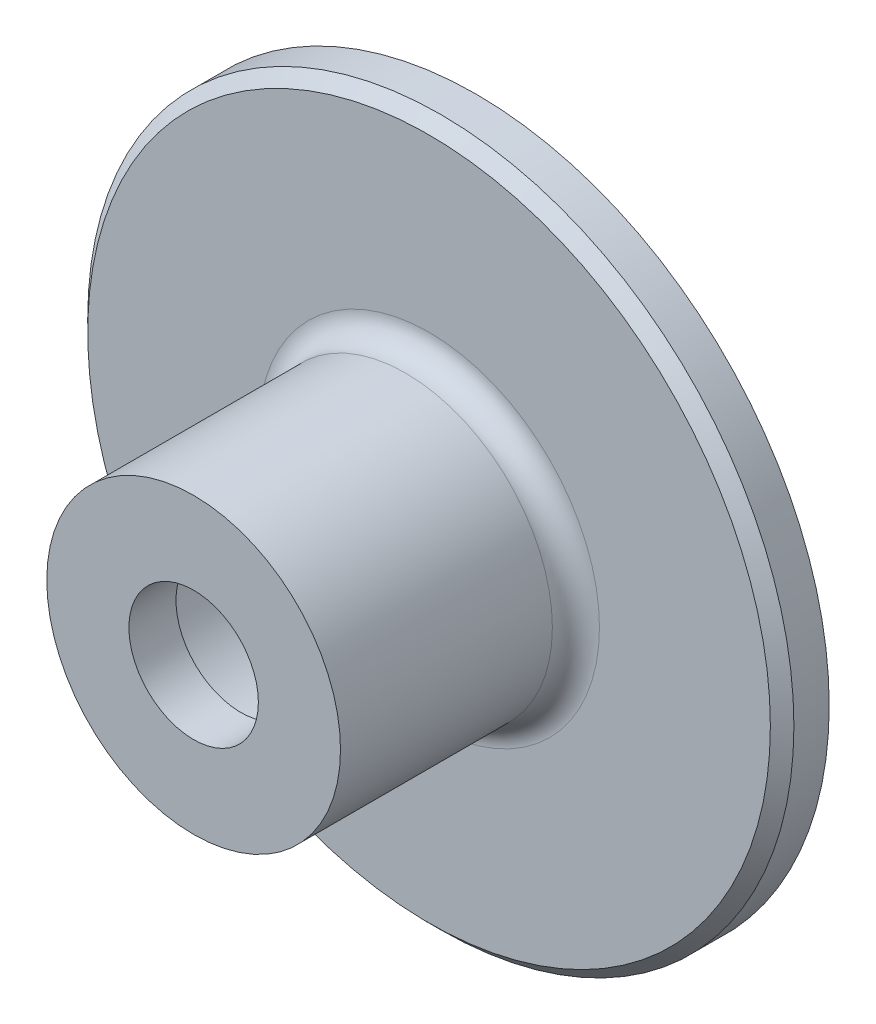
from build123d import *

# Parameters (mm, degrees)
CROQUIS1_R              = 9.282421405
CROQUIS1_R_2            = 6.239004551
CROQUIS1_R_3            = 4.239004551
SALIENTE_EXTRUIR2_DEPTH = 2
CROQUIS1_5_R            = 6.239004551
CROQUIS1_5_R_2          = 4.239004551
SALIENTE_EXTRUIR3_DEPTH = 10
SALIENTE_EXTRUIR4_START = 10
CROQUIS1_6_R            = 6.239004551
CROQUIS1_6_R_2          = 4.239004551
CROQUIS1_6_R_3          = 2.75
SALIENTE_EXTRUIR4_DEPTH = 2
CHAFL_N1_SIZE           = 1
REDONDEO1_R             = 1
REDONDEO2_R             = 0.5
CROQUIS2_R              = 15
CROQUIS2_R_2            = 9.282421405
CROQUIS2_R_3            = 4.239004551
SALIENTE_EXTRUIR6_DEPTH = 2
CHAFL_N2_SIZE           = 0.5
CORTAR_EXTRUIR1_DEPTH   = 1
SALIENTE_EXTRUIR7_DEPTH = 1


with BuildPart() as part:
    # Croquis1 → Saliente-Extruir2 (new body)
    # profile 1 of 2: a face of its own
    with BuildSketch(Plane.XY):
        with Locations((-28.365830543, -486.980432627)):
            Circle(CROQUIS1_R)
        with Locations((-28.365830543, -486.980432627)):
            Circle(CROQUIS1_R_2, mode=Mode.SUBTRACT)
    # profile 2 of 2: a face of its own
    with BuildSketch(Plane.XY):
        with Locations((-28.365830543, -486.980432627)):
            Circle(CROQUIS1_R_2)
        with Locations((-28.365830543, -486.980432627)):
            Circle(CROQUIS1_R_3, mode=Mode.SUBTRACT)
    extrude(amount=SALIENTE_EXTRUIR2_DEPTH)

    # Croquis1_5 → Saliente-Extruir3 (add)
    with BuildSketch(Plane.XY):
        with Locations((-28.365830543, -486.980432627)):
            Circle(CROQUIS1_5_R)
        with Locations((-28.365830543, -486.980432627)):
            Circle(CROQUIS1_5_R_2, mode=Mode.SUBTRACT)
    extrude(amount=SALIENTE_EXTRUIR3_DEPTH)

    # Croquis1_6 → Saliente-Extruir4 (add)
    # profile 1 of 2: a face of its own
    with BuildSketch(Plane.XY.offset(SALIENTE_EXTRUIR4_START)):
        with Locations((-28.365830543, -486.980432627)):
            Circle(CROQUIS1_6_R)
        with Locations((-28.365830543, -486.980432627)):
            Circle(CROQUIS1_6_R_2, mode=Mode.SUBTRACT)
    # profile 2 of 2: a face of its own
    with BuildSketch(Plane.XY.offset(SALIENTE_EXTRUIR4_START)):
        with Locations((-28.365830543, -486.980432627)):
            Circle(CROQUIS1_6_R_2)
        with Locations((-28.365830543, -486.980432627)):
            Circle(CROQUIS1_6_R_3, mode=Mode.SUBTRACT)
    extrude(amount=SALIENTE_EXTRUIR4_DEPTH)

    # Chafl_n1
    chafl_n1_edges = [part.edges().sort_by_distance(p)[0] for p in [
        (-37.648251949, -486.980432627, 2),
    ]]
    chamfer(chafl_n1_edges, length=CHAFL_N1_SIZE)

    # Redondeo1
    redondeo1_edges = [part.edges().sort_by_distance(p)[0] for p in [
        (-34.604835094, -486.980432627, 2),
    ]]
    fillet(redondeo1_edges, radius=REDONDEO1_R)

    # Redondeo2
    redondeo2_edges = [part.edges().sort_by_distance(p)[0] for p in [
        (-32.604835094, -486.980432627, 10),
    ]]
    fillet(redondeo2_edges, radius=REDONDEO2_R)

    # Croquis2 → Saliente-Extruir6 (add)
    # profile 1 of 2: a face of its own
    with BuildSketch(Plane(origin=(0, 0, 0), x_dir=(-1, 0, 0), z_dir=(0, 0, -1))):
        with Locations((28.365830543, -486.980432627)):
            Circle(CROQUIS2_R)
        with Locations((28.365830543, -486.980432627)):
            Circle(CROQUIS2_R_2, mode=Mode.SUBTRACT)
    # profile 2 of 2: a face of its own
    with BuildSketch(Plane(origin=(0, 0, 0), x_dir=(-1, 0, 0), z_dir=(0, 0, -1))):
        with Locations((28.365830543, -486.980432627)):
            Circle(CROQUIS2_R_2)
        with Locations(Location((28.365830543, -486.980432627, 0), (0, 0, 180))):
            Circle(CROQUIS2_R_3, mode=Mode.SUBTRACT)
    extrude(amount=-SALIENTE_EXTRUIR6_DEPTH)

    # Chafl_n2
    chafl_n2_edges = [part.edges().sort_by_distance(p)[0] for p in [
        (-13.365830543, -486.980432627, 2),
    ]]
    chamfer(chafl_n2_edges, length=CHAFL_N2_SIZE)

    # Croquis3 → Cortar-Extruir1 (cut)
    with BuildSketch(Plane(origin=(0, 0, 0), x_dir=(-1, 0, 0), z_dir=(0, 0, -1))):
        with BuildLine():
            ThreePointArc((23.688219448, -487.740773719), (23.858769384, -485.515999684), (25.028480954, -483.615872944))
            ThreePointArc((25.028480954, -483.615872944), (23.226031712, -482.738989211), (21.285773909, -482.235851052))
            Line((21.285773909, -482.235851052), (18.961266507, -483.924704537))
            Line((18.961266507, -483.924704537), (19.849149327, -486.657326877))
            ThreePointArc((19.849149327, -486.657326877), (21.714588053, -487.390734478), (23.688219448, -487.740773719))
        make_face()
        with BuildLine():
            ThreePointArc((35.445887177, -482.235851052), (33.505629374, -482.738989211), (31.703180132, -483.615872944))
            ThreePointArc((31.703180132, -483.615872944), (32.740409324, -485.158009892), (33.104835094, -486.980432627))
            ThreePointArc((33.104835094, -486.980432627), (33.089461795, -487.361840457), (33.043441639, -487.740773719))
            ThreePointArc((33.043441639, -487.740773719), (35.017073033, -487.390734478), (36.882511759, -486.657326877))
            Line((36.882511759, -486.657326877), (37.77039458, -483.924704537))
            Line((37.77039458, -483.924704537), (35.445887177, -482.235851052))
        make_face()
        with BuildLine():
            ThreePointArc((35.066053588, -492.247810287), (33.987968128, -490.557993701), (32.597014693, -489.11473458))
            ThreePointArc((32.597014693, -489.11473458), (31.151347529, -490.814367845), (29.088164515, -491.664063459))
            ThreePointArc((29.088164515, -491.664063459), (30.030957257, -493.432930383), (31.304921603, -494.980432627))
            Line((31.304921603, -494.980432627), (34.178170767, -494.980432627))
            Line((34.178170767, -494.980432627), (35.066053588, -492.247810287))
        make_face()
        with BuildLine():
            ThreePointArc((27.643496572, -491.664063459), (25.580313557, -490.814367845), (24.134646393, -489.11473458))
            ThreePointArc((24.134646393, -489.11473458), (22.743692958, -490.557993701), (21.665607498, -492.247810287))
            Line((21.665607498, -492.247810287), (22.553490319, -494.980432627))
            Line((22.553490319, -494.980432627), (25.426739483, -494.980432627))
            ThreePointArc((25.426739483, -494.980432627), (26.70070383, -493.432930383), (27.643496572, -491.664063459))
        make_face()
        with BuildLine():
            Line((30.690337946, -478.780742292), (28.365830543, -477.091888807))
            Line((28.365830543, -477.091888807), (26.041323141, -478.780742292))
            ThreePointArc((26.041323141, -478.780742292), (25.920263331, -480.78151536), (26.197241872, -482.766718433))
            ThreePointArc((26.197241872, -482.766718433), (28.365830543, -482.241428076), (30.534419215, -482.766718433))
            ThreePointArc((30.534419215, -482.766718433), (30.811397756, -480.78151536), (30.690337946, -478.780742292))
        make_face()
        with BuildLine():
            Line((26.041323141, -478.780742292), (28.365830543, -477.091888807))
            Line((28.365830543, -477.091888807), (27.190260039, -475.473854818))
            Line((27.190260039, -475.473854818), (26.043138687, -478.769529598))
            ThreePointArc((26.043138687, -478.769529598), (26.042229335, -478.775135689), (26.041323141, -478.780742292))
        make_face()
        with BuildLine():
            Line((29.541401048, -475.473854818), (28.365830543, -477.091888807))
            Line((28.365830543, -477.091888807), (30.690337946, -478.780742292))
            ThreePointArc((30.690337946, -478.780742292), (30.689431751, -478.775135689), (30.688522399, -478.769529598))
            Line((30.688522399, -478.769529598), (29.541401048, -475.473854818))
        make_face()
        with BuildLine():
            Line((21.274548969, -482.234112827), (17.785696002, -482.306670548))
            Line((17.785696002, -482.306670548), (18.961266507, -483.924704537))
            Line((18.961266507, -483.924704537), (21.285773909, -482.235851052))
            ThreePointArc((21.285773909, -482.235851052), (21.280161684, -482.234980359), (21.274548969, -482.234112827))
        make_face()
        with BuildLine():
            Line((19.849149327, -486.657326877), (18.961266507, -483.924704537))
            Line((18.961266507, -483.924704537), (17.059153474, -484.542738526))
            Line((17.059153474, -484.542738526), (19.839046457, -486.652135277))
            ThreePointArc((19.839046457, -486.652135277), (19.844097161, -486.654732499), (19.849149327, -486.657326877))
        make_face()
        with BuildLine():
            Line((21.660485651, -492.257948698), (20.651377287, -495.598466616))
            Line((20.651377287, -495.598466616), (22.553490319, -494.980432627))
            Line((22.553490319, -494.980432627), (21.665607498, -492.247810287))
            ThreePointArc((21.665607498, -492.247810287), (21.663045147, -492.252878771), (21.660485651, -492.257948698))
        make_face()
        with BuildLine():
            Line((25.426739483, -494.980432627), (22.553490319, -494.980432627))
            Line((22.553490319, -494.980432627), (22.553490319, -496.980432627))
            Line((22.553490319, -496.980432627), (25.418680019, -494.988436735))
            ThreePointArc((25.418680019, -494.988436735), (25.422710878, -494.984435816), (25.426739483, -494.980432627))
        make_face()
        with BuildLine():
            Line((34.178170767, -496.980432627), (34.178170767, -494.980432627))
            Line((34.178170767, -494.980432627), (31.304921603, -494.980432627))
            ThreePointArc((31.304921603, -494.980432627), (31.308950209, -494.984435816), (31.312981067, -494.988436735))
            Line((31.312981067, -494.988436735), (34.178170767, -496.980432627))
        make_face()
        with BuildLine():
            Line((34.178170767, -494.980432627), (36.0802838, -495.598466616))
            Line((36.0802838, -495.598466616), (35.071175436, -492.257948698))
            ThreePointArc((35.071175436, -492.257948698), (35.068615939, -492.252878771), (35.066053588, -492.247810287))
            Line((35.066053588, -492.247810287), (34.178170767, -494.980432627))
        make_face()
        with BuildLine():
            Line((39.672507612, -484.542738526), (37.77039458, -483.924704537))
            Line((37.77039458, -483.924704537), (36.882511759, -486.657326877))
            ThreePointArc((36.882511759, -486.657326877), (36.887563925, -486.654732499), (36.89261463, -486.652135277))
            Line((36.89261463, -486.652135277), (39.672507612, -484.542738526))
        make_face()
        with BuildLine():
            Line((37.77039458, -483.924704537), (38.945965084, -482.306670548))
            Line((38.945965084, -482.306670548), (35.457112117, -482.234112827))
            ThreePointArc((35.457112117, -482.234112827), (35.451499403, -482.234980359), (35.445887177, -482.235851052))
            Line((35.445887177, -482.235851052), (37.77039458, -483.924704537))
        make_face()
    extrude(amount=-CORTAR_EXTRUIR1_DEPTH, mode=Mode.SUBTRACT)

    # Croquis4 → Saliente-Extruir7 (add)
    with BuildSketch(Plane(origin=(0, 0, 1), x_dir=(-1, 0, 0), z_dir=(0, 0, -1))):
        with BuildLine():
            ThreePointArc((24.246582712, -483.743309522), (23.383241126, -485.361491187), (23.130555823, -487.178087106))
            ThreePointArc((23.130555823, -487.178087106), (21.578756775, -486.828516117), (20.106128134, -486.227146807))
            Line((20.106128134, -486.227146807), (18.123429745, -484.722665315))
            Line((18.123429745, -484.722665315), (19.770283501, -484.187570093))
            Line((19.770283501, -484.187570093), (18.752471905, -482.786672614))
            Line((18.752471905, -482.786672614), (21.24082063, -482.734922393))
            ThreePointArc((21.24082063, -482.734922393), (22.785678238, -483.113993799), (24.246582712, -483.743309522))
        make_face()
        with BuildLine():
            ThreePointArc((30.171599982, -482.062469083), (28.365830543, -481.741428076), (26.560061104, -482.062469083))
            ThreePointArc((26.560061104, -482.062469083), (26.412990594, -480.47859711), (26.529859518, -478.892210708))
            Line((26.529859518, -478.892210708), (27.348018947, -476.541642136))
            Line((27.348018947, -476.541642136), (28.365830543, -477.942539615))
            Line((28.365830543, -477.942539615), (29.383642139, -476.541642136))
            Line((29.383642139, -476.541642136), (30.201801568, -478.892210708))
            ThreePointArc((30.201801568, -478.892210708), (30.318670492, -480.47859711), (30.171599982, -482.062469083))
        make_face()
        with BuildLine():
            ThreePointArc((33.601105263, -487.178087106), (33.348419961, -485.361491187), (32.485078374, -483.743309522))
            ThreePointArc((32.485078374, -483.743309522), (33.945982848, -483.113993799), (35.490840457, -482.734922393))
            Line((35.490840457, -482.734922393), (37.979189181, -482.786672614))
            Line((37.979189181, -482.786672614), (36.961377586, -484.187570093))
            Line((36.961377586, -484.187570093), (38.608231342, -484.722665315))
            Line((38.608231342, -484.722665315), (36.625532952, -486.227146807))
            ThreePointArc((36.625532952, -486.227146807), (35.152904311, -486.828516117), (33.601105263, -487.178087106))
        make_face()
        with BuildLine():
            ThreePointArc((29.795638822, -492.020553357), (31.445240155, -491.218876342), (32.71743515, -489.897744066))
            ThreePointArc((32.71743515, -489.897744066), (33.767394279, -491.092677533), (34.605299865, -492.444784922))
            Line((34.605299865, -492.444784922), (35.325024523, -494.827336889))
            Line((35.325024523, -494.827336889), (33.678170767, -494.292241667))
            Line((33.678170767, -494.292241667), (33.678170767, -496.02384618))
            Line((33.678170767, -496.02384618), (31.634636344, -494.603098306))
            ThreePointArc((31.634636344, -494.603098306), (30.607632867, -493.388378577), (29.795638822, -492.020553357))
        make_face()
        with BuildLine():
            ThreePointArc((24.014225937, -489.897744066), (25.286420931, -491.218876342), (26.936022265, -492.020553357))
            ThreePointArc((26.936022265, -492.020553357), (26.12402822, -493.388378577), (25.097024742, -494.603098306))
            Line((25.097024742, -494.603098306), (23.053490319, -496.02384618))
            Line((23.053490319, -496.02384618), (23.053490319, -494.292241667))
            Line((23.053490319, -494.292241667), (21.406636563, -494.827336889))
            Line((21.406636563, -494.827336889), (22.126361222, -492.444784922))
            ThreePointArc((22.126361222, -492.444784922), (22.964266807, -491.092677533), (24.014225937, -489.897744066))
        make_face()
    extrude(amount=SALIENTE_EXTRUIR7_DEPTH)


solid = part.part
